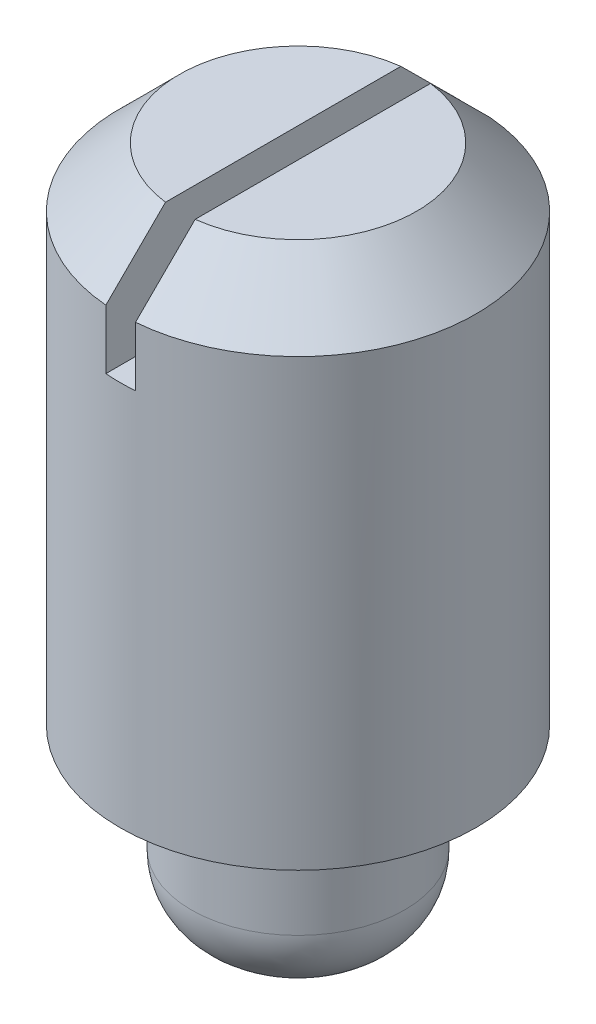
ISO-10303-21;
HEADER;
FILE_DESCRIPTION(('STEP AP214'),'2;1');
FILE_NAME('part.step','',(''),(''),'','','');
FILE_SCHEMA(('AUTOMOTIVE_DESIGN { 1 0 10303 214 1 1 1 1 }'));
ENDSEC;
DATA;
#1=APPLICATION_CONTEXT('core data for automotive mechanical design processes');
#2=APPLICATION_PROTOCOL_DEFINITION('international standard','automotive_design',2000,#1);
#3=PRODUCT_CONTEXT('',#1,'mechanical');
#4=PRODUCT('Part','Part','',(#3));
#5=PRODUCT_RELATED_PRODUCT_CATEGORY('part','',(#4));
#6=PRODUCT_DEFINITION_FORMATION('','',#4);
#7=PRODUCT_DEFINITION_CONTEXT('part definition',#1,'design');
#8=PRODUCT_DEFINITION('design','',#6,#7);
#9=PRODUCT_DEFINITION_SHAPE('','',#8);
#10=(LENGTH_UNIT() NAMED_UNIT(*) SI_UNIT(.MILLI.,.METRE.));
#11=(NAMED_UNIT(*) PLANE_ANGLE_UNIT() SI_UNIT($,.RADIAN.));
#12=(NAMED_UNIT(*) SI_UNIT($,.STERADIAN.) SOLID_ANGLE_UNIT());
#13=UNCERTAINTY_MEASURE_WITH_UNIT(LENGTH_MEASURE(1.E-05),#10,'distance_accuracy_value','');
#14=(GEOMETRIC_REPRESENTATION_CONTEXT(3) GLOBAL_UNCERTAINTY_ASSIGNED_CONTEXT((#13)) GLOBAL_UNIT_ASSIGNED_CONTEXT((#10,
#11,#12)) REPRESENTATION_CONTEXT('',''));
#15=CARTESIAN_POINT('',(0.,0.,0.));
#16=DIRECTION('',(0.,0.,1.));
#17=DIRECTION('',(1.,0.,0.));
#18=AXIS2_PLACEMENT_3D('',#15,#16,#17);
#19=CARTESIAN_POINT('',(0.,8.5,0.));
#20=DIRECTION('',(0.,1.,0.));
#21=DIRECTION('',(0.,0.,1.));
#22=AXIS2_PLACEMENT_3D('',#19,#20,#21);
#23=PLANE('',#22);
#24=DIRECTION('',(0.,0.,1.));
#25=VECTOR('',#24,1.);
#26=CARTESIAN_POINT('',(-0.25,8.5,-3.1191553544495));
#27=LINE('',#26,#25);
#28=CARTESIAN_POINT('',(-0.25,8.5,-1.98431348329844));
#29=VERTEX_POINT('',#28);
#30=CARTESIAN_POINT('',(-0.25,8.5,1.98431348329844));
#31=VERTEX_POINT('',#30);
#32=EDGE_CURVE('E88',#29,#31,#27,.T.);
#33=ORIENTED_EDGE('',*,*,#32,.F.);
#34=CARTESIAN_POINT('',(0.,8.5,0.));
#35=DIRECTION('',(0.,1.,0.));
#36=DIRECTION('',(0.,0.,1.));
#37=AXIS2_PLACEMENT_3D('',#34,#35,#36);
#38=CIRCLE('',#37,2.);
#39=EDGE_CURVE('E97',#29,#31,#38,.T.);
#40=ORIENTED_EDGE('',*,*,#39,.T.);
#41=EDGE_LOOP('',(#33,#40));
#42=FACE_BOUND('',#41,.T.);
#43=ADVANCED_FACE('F35',(#42),#23,.T.);
#44=CARTESIAN_POINT('',(0.,8.5,0.));
#45=DIRECTION('',(0.,-1.,0.));
#46=DIRECTION('',(0.,0.,-1.));
#47=AXIS2_PLACEMENT_3D('',#44,#45,#46);
#48=CONICAL_SURFACE('',#47,2.,0.785398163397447);
#49=CARTESIAN_POINT('',(-0.25,3.85014248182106,-6.64515650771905));
#50=CARTESIAN_POINT('',(-0.25,4.08043884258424,-6.41469591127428));
#51=CARTESIAN_POINT('',(-0.25,4.31072797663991,-6.18422809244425));
#52=CARTESIAN_POINT('',(-0.25,4.77128285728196,-5.72326810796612));
#53=CARTESIAN_POINT('',(-0.25,5.0015486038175,-5.49277594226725));
#54=CARTESIAN_POINT('',(-0.25,5.46205818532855,-5.03174693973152));
#55=CARTESIAN_POINT('',(-0.25,5.69230201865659,-4.80121010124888));
#56=CARTESIAN_POINT('',(-0.25,6.15273805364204,-4.34008582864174));
#57=CARTESIAN_POINT('',(-0.25,6.38293025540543,-4.10949839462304));
#58=CARTESIAN_POINT('',(-0.25,6.841542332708,-3.64993627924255));
#59=CARTESIAN_POINT('',(-0.25,7.069962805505,-3.42096219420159));
#60=CARTESIAN_POINT('',(-0.25,7.52665808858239,-2.96286612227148));
#61=CARTESIAN_POINT('',(-0.25,7.75493289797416,-2.73374413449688));
#62=CARTESIAN_POINT('',(-0.25,8.21119878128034,-2.27523083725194));
#63=CARTESIAN_POINT('',(-0.25,8.43918986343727,-2.04583953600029));
#64=CARTESIAN_POINT('',(-0.25,8.78060581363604,-1.70118943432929));
#65=CARTESIAN_POINT('',(-0.25,8.89431546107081,-1.58621277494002));
#66=CARTESIAN_POINT('',(-0.25,9.12137898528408,-1.35590884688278));
#67=CARTESIAN_POINT('',(-0.25,9.23473286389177,-1.24058158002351));
#68=CARTESIAN_POINT('',(-0.25,9.3787007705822,-1.09309500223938));
#69=CARTESIAN_POINT('',(-0.25,9.40968300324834,-1.06129546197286));
#70=CARTESIAN_POINT('',(-0.25,9.47156411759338,-0.99761535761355));
#71=CARTESIAN_POINT('',(-0.25,9.50246299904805,-0.965734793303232));
#72=CARTESIAN_POINT('',(-0.25,9.59506728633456,-0.869876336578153));
#73=CARTESIAN_POINT('',(-0.25,9.65661671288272,-0.805746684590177));
#74=CARTESIAN_POINT('',(-0.25,9.75868594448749,-0.698020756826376));
#75=CARTESIAN_POINT('',(-0.25,9.79943458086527,-0.654641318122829));
#76=CARTESIAN_POINT('',(-0.25,9.88021819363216,-0.567372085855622));
#77=CARTESIAN_POINT('',(-0.25,9.92025439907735,-0.523483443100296));
#78=CARTESIAN_POINT('',(-0.25,9.9860229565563,-0.44928573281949));
#79=CARTESIAN_POINT('',(-0.25,10.0121055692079,-0.41928765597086));
#80=CARTESIAN_POINT('',(-0.25,10.0634403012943,-0.358282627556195));
#81=CARTESIAN_POINT('',(-0.25,10.088686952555,-0.327270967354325));
#82=CARTESIAN_POINT('',(-0.25,10.1252181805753,-0.279403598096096));
#83=CARTESIAN_POINT('',(-0.25,10.13724277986,-0.263117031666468));
#84=CARTESIAN_POINT('',(-0.25,10.1605042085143,-0.229994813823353));
#85=CARTESIAN_POINT('',(-0.25,10.1717414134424,-0.213159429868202));
#86=CARTESIAN_POINT('',(-0.25,10.1929127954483,-0.178840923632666));
#87=CARTESIAN_POINT('',(-0.25,10.2028558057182,-0.161363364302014));
#88=CARTESIAN_POINT('',(-0.25,10.2207322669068,-0.125430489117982));
#89=CARTESIAN_POINT('',(-0.25,10.2286716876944,-0.10697828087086));
#90=CARTESIAN_POINT('',(-0.25,10.2407351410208,-0.0705946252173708));
#91=CARTESIAN_POINT('',(-0.25,10.2451332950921,-0.0527600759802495));
#92=CARTESIAN_POINT('',(-0.25,10.2500734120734,-0.0166397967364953));
#93=CARTESIAN_POINT('',(-0.25,10.2506413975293,0.00164203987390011));
#94=CARTESIAN_POINT('',(-0.25,10.2478040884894,0.0378157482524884));
#95=CARTESIAN_POINT('',(-0.25,10.2444092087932,0.0557085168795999));
#96=CARTESIAN_POINT('',(-0.25,10.2345851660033,0.0907392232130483));
#97=CARTESIAN_POINT('',(-0.25,10.2281306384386,0.107869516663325));
#98=CARTESIAN_POINT('',(-0.25,10.2144442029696,0.138562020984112));
#99=CARTESIAN_POINT('',(-0.25,10.2074993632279,0.152258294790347));
#100=CARTESIAN_POINT('',(-0.25,10.1926531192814,0.179128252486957));
#101=CARTESIAN_POINT('',(-0.25,10.1847509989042,0.192301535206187));
#102=CARTESIAN_POINT('',(-0.25,10.1600232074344,0.23128765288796));
#103=CARTESIAN_POINT('',(-0.25,10.1422227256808,0.256474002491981));
#104=CARTESIAN_POINT('',(-0.25,10.1051554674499,0.306055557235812));
#105=CARTESIAN_POINT('',(-0.25,10.0858771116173,0.33044179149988));
#106=CARTESIAN_POINT('',(-0.25,10.0465830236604,0.378519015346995));
#107=CARTESIAN_POINT('',(-0.25,10.0265690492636,0.402211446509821));
#108=CARTESIAN_POINT('',(-0.25,9.96670628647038,0.471649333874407));
#109=CARTESIAN_POINT('',(-0.25,9.92619261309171,0.516816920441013));
#110=CARTESIAN_POINT('',(-0.25,9.84433312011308,0.606395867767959));
#111=CARTESIAN_POINT('',(-0.25,9.80298714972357,0.650807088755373));
#112=CARTESIAN_POINT('',(-0.25,9.71977538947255,0.73923985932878));
#113=CARTESIAN_POINT('',(-0.25,9.67790903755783,0.783260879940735));
#114=CARTESIAN_POINT('',(-0.25,9.59389453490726,0.871025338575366));
#115=CARTESIAN_POINT('',(-0.25,9.55174640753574,0.914768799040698));
#116=CARTESIAN_POINT('',(-0.25,9.42569801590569,1.04504184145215));
#117=CARTESIAN_POINT('',(-0.25,9.3415297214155,1.13131190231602));
#118=CARTESIAN_POINT('',(-0.25,9.1728840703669,1.30346505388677));
#119=CARTESIAN_POINT('',(-0.25,9.08840688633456,1.38934831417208));
#120=CARTESIAN_POINT('',(-0.25,8.83446367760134,1.64692538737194));
#121=CARTESIAN_POINT('',(-0.25,8.6647008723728,1.81832652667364));
#122=CARTESIAN_POINT('',(-0.25,8.32486250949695,2.16081934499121));
#123=CARTESIAN_POINT('',(-0.25,8.15478695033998,2.33191102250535));
#124=CARTESIAN_POINT('',(-0.25,7.81443472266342,2.67395859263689));
#125=CARTESIAN_POINT('',(-0.25,7.64415802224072,2.84491445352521));
#126=CARTESIAN_POINT('',(-0.25,7.30350887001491,3.18673010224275));
#127=CARTESIAN_POINT('',(-0.25,7.1331364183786,3.35758989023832));
#128=CARTESIAN_POINT('',(-0.25,6.62108011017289,3.87093270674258));
#129=CARTESIAN_POINT('',(-0.25,6.27930673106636,4.21332643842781));
#130=CARTESIAN_POINT('',(-0.25,5.59566744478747,4.897990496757));
#131=CARTESIAN_POINT('',(-0.25,5.25380154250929,5.24026082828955));
#132=CARTESIAN_POINT('',(-0.25,4.73487095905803,5.75971138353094));
#133=CARTESIAN_POINT('',(-0.25,4.55782892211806,5.93691422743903));
#134=CARTESIAN_POINT('',(-0.25,4.20390695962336,6.29113175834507));
#135=CARTESIAN_POINT('',(-0.25,4.02702704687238,6.468146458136));
#136=CARTESIAN_POINT('',(-0.25,3.85014248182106,6.64515650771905));
#137=B_SPLINE_CURVE_WITH_KNOTS('',3,(#49,#50,#51,#52,#53,#54,#55,#56,#57,#58,#59,#60,#61,#62,
#63,#64,#65,#66,#67,#68,#69,#70,#71,#72,#73,#74,#75,#76,#77,#78,#79,#80,#81,#82,#83,#84,#85,#86,
#87,#88,#89,#90,#91,#92,#93,#94,#95,#96,#97,#98,#99,#100,#101,#102,#103,#104,#105,#106,#107,
#108,#109,#110,#111,#112,#113,#114,#115,#116,#117,#118,#119,#120,#121,#122,#123,#124,#125,#126,
#127,#128,#129,#130,#131,#132,#133,#134,#135,#136),.UNSPECIFIED.,.F.,.F.,(4,2,2,2,2,2,2,2,2,2,2,
2,2,2,2,2,2,2,2,2,2,2,2,2,2,2,2,2,2,2,2,2,2,2,2,2,2,2,2,2,2,2,2,4),(0.,0.977413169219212,
1.95482841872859,2.93229202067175,3.90975359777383,4.88003460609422,5.85032147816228,
6.82057947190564,7.30570370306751,7.79082543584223,7.924016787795,8.05720849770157,
8.32386479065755,8.50241290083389,8.6806152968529,8.79986327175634,8.91977897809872,
8.98049839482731,9.04118865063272,9.10144013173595,9.16150991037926,9.21629726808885,
9.2707120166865,9.32498407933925,9.37971414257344,9.42573656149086,9.4717936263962,
9.56421742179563,9.65745891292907,9.75049049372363,9.93248905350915,10.1145208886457,
10.2967702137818,10.4790046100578,10.8405837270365,11.2019848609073,11.9257096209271,
12.6494378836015,13.373302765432,14.0971663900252,15.5485045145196,16.9997768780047,
17.7512438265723,18.5019677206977),.UNSPECIFIED.);
#138=CARTESIAN_POINT('',(-0.25,7.49999999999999,-2.98956518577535));
#139=VERTEX_POINT('',#138);
#140=EDGE_CURVE('E85',#139,#29,#137,.T.);
#141=ORIENTED_EDGE('',*,*,#140,.F.);
#142=CARTESIAN_POINT('',(0.,7.49999999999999,0.));
#143=DIRECTION('',(0.,1.,0.));
#144=DIRECTION('',(0.,0.,1.));
#145=AXIS2_PLACEMENT_3D('',#142,#143,#144);
#146=CIRCLE('',#145,3.);
#147=CARTESIAN_POINT('',(-0.25,7.49999999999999,2.98956518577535));
#148=VERTEX_POINT('',#147);
#149=EDGE_CURVE('E109',#148,#139,#146,.F.);
#150=ORIENTED_EDGE('',*,*,#149,.F.);
#151=EDGE_CURVE('E94',#31,#148,#137,.T.);
#152=ORIENTED_EDGE('',*,*,#151,.F.);
#153=ORIENTED_EDGE('',*,*,#39,.F.);
#154=EDGE_LOOP('',(#141,#150,#152,#153));
#155=FACE_BOUND('',#154,.T.);
#156=ADVANCED_FACE('F99',(#155),#48,.T.);
#157=CARTESIAN_POINT('',(0.,0.,0.));
#158=DIRECTION('',(0.,1.,0.));
#159=DIRECTION('',(0.,0.,1.));
#160=AXIS2_PLACEMENT_3D('',#157,#158,#159);
#161=PLANE('',#160);
#162=CARTESIAN_POINT('',(0.,0.,0.));
#163=DIRECTION('',(0.,1.,0.));
#164=DIRECTION('',(0.,0.,1.));
#165=AXIS2_PLACEMENT_3D('',#162,#163,#164);
#166=CIRCLE('',#165,2.3);
#167=CARTESIAN_POINT('',(0.,0.,2.3));
#168=VERTEX_POINT('',#167);
#169=EDGE_CURVE('E114',#168,#168,#166,.T.);
#170=ORIENTED_EDGE('',*,*,#169,.T.);
#171=EDGE_LOOP('',(#170));
#172=FACE_BOUND('',#171,.T.);
#173=CARTESIAN_POINT('',(0.,0.,0.));
#174=DIRECTION('',(0.,1.,0.));
#175=DIRECTION('',(0.,0.,1.));
#176=AXIS2_PLACEMENT_3D('',#173,#174,#175);
#177=CIRCLE('',#176,3.);
#178=CARTESIAN_POINT('',(0.,0.,3.));
#179=VERTEX_POINT('',#178);
#180=EDGE_CURVE('E101',#179,#179,#177,.T.);
#181=ORIENTED_EDGE('',*,*,#180,.F.);
#182=EDGE_LOOP('',(#181));
#183=FACE_BOUND('',#182,.T.);
#184=ADVANCED_FACE('F166',(#172,#183),#161,.F.);
#185=CARTESIAN_POINT('',(0.,8.5,0.));
#186=DIRECTION('',(0.,-1.,0.));
#187=DIRECTION('',(0.,0.,-1.));
#188=AXIS2_PLACEMENT_3D('',#185,#186,#187);
#189=CYLINDRICAL_SURFACE('',#188,3.);
#190=ORIENTED_EDGE('',*,*,#149,.T.);
#191=DIRECTION('',(0.,-1.,0.));
#192=VECTOR('',#191,1.);
#193=CARTESIAN_POINT('',(-0.25,8.5,-2.98956518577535));
#194=LINE('',#193,#192);
#195=CARTESIAN_POINT('',(-0.25,6.5,-2.98956518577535));
#196=VERTEX_POINT('',#195);
#197=EDGE_CURVE('E58',#139,#196,#194,.T.);
#198=ORIENTED_EDGE('',*,*,#197,.T.);
#199=CARTESIAN_POINT('',(0.,6.5,0.));
#200=DIRECTION('',(0.,1.,0.));
#201=DIRECTION('',(0.,0.,1.));
#202=AXIS2_PLACEMENT_3D('',#199,#200,#201);
#203=CIRCLE('',#202,3.);
#204=CARTESIAN_POINT('',(0.249999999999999,6.5,-2.98956518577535));
#205=VERTEX_POINT('',#204);
#206=EDGE_CURVE('E11',#205,#196,#203,.T.);
#207=ORIENTED_EDGE('',*,*,#206,.F.);
#208=DIRECTION('',(0.,-1.,0.));
#209=VECTOR('',#208,1.);
#210=CARTESIAN_POINT('',(0.25,8.5,-2.98956518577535));
#211=LINE('',#210,#209);
#212=CARTESIAN_POINT('',(0.25,7.49999999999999,-2.98956518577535));
#213=VERTEX_POINT('',#212);
#214=EDGE_CURVE('E186',#205,#213,#211,.F.);
#215=ORIENTED_EDGE('',*,*,#214,.T.);
#216=CARTESIAN_POINT('',(0.25,7.49999999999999,2.98956518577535));
#217=VERTEX_POINT('',#216);
#218=EDGE_CURVE('E104',#213,#217,#146,.F.);
#219=ORIENTED_EDGE('',*,*,#218,.T.);
#220=DIRECTION('',(0.,-1.,0.));
#221=VECTOR('',#220,1.);
#222=CARTESIAN_POINT('',(0.25,8.5,2.98956518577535));
#223=LINE('',#222,#221);
#224=CARTESIAN_POINT('',(0.249999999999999,6.5,2.98956518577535));
#225=VERTEX_POINT('',#224);
#226=EDGE_CURVE('E191',#217,#225,#223,.T.);
#227=ORIENTED_EDGE('',*,*,#226,.T.);
#228=CARTESIAN_POINT('',(-0.25,6.5,2.98956518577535));
#229=VERTEX_POINT('',#228);
#230=EDGE_CURVE('E39',#229,#225,#203,.T.);
#231=ORIENTED_EDGE('',*,*,#230,.F.);
#232=DIRECTION('',(0.,-1.,0.));
#233=VECTOR('',#232,1.);
#234=CARTESIAN_POINT('',(-0.25,8.5,2.98956518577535));
#235=LINE('',#234,#233);
#236=EDGE_CURVE('E194',#229,#148,#235,.F.);
#237=ORIENTED_EDGE('',*,*,#236,.T.);
#238=EDGE_LOOP('',(#190,#198,#207,#215,#219,#227,#231,#237));
#239=FACE_BOUND('',#238,.T.);
#240=ORIENTED_EDGE('',*,*,#180,.T.);
#241=EDGE_LOOP('',(#240));
#242=FACE_BOUND('',#241,.T.);
#243=ADVANCED_FACE('F37',(#239,#242),#189,.T.);
#244=DIRECTION('',(0.,0.,-1.));
#245=VECTOR('',#244,1.);
#246=CARTESIAN_POINT('',(0.25,8.5,-3.1191553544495));
#247=LINE('',#246,#245);
#248=CARTESIAN_POINT('',(0.249999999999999,8.5,1.98431348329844));
#249=VERTEX_POINT('',#248);
#250=CARTESIAN_POINT('',(0.25,8.5,-1.98431348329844));
#251=VERTEX_POINT('',#250);
#252=EDGE_CURVE('E50',#249,#251,#247,.T.);
#253=ORIENTED_EDGE('',*,*,#252,.F.);
#254=EDGE_CURVE('E100',#249,#251,#38,.T.);
#255=ORIENTED_EDGE('',*,*,#254,.T.);
#256=EDGE_LOOP('',(#253,#255));
#257=FACE_BOUND('',#256,.T.);
#258=ADVANCED_FACE('F162',(#257),#23,.T.);
#259=CARTESIAN_POINT('',(0.,3.,0.));
#260=DIRECTION('',(0.,-1.,0.));
#261=DIRECTION('',(0.,0.,-1.));
#262=AXIS2_PLACEMENT_3D('',#259,#260,#261);
#263=CYLINDRICAL_SURFACE('',#262,1.8);
#264=CARTESIAN_POINT('',(0.,-1.8,0.));
#265=DIRECTION('',(0.,1.,0.));
#266=DIRECTION('',(0.,0.,1.));
#267=AXIS2_PLACEMENT_3D('',#264,#265,#266);
#268=CIRCLE('',#267,1.8);
#269=CARTESIAN_POINT('',(0.,-1.8,1.8));
#270=VERTEX_POINT('',#269);
#271=EDGE_CURVE('E117',#270,#270,#268,.T.);
#272=ORIENTED_EDGE('',*,*,#271,.T.);
#273=EDGE_LOOP('',(#272));
#274=FACE_BOUND('',#273,.T.);
#275=CARTESIAN_POINT('',(0.,-0.5,0.));
#276=DIRECTION('',(0.,1.,0.));
#277=DIRECTION('',(0.,0.,1.));
#278=AXIS2_PLACEMENT_3D('',#275,#276,#277);
#279=CIRCLE('',#278,1.8);
#280=CARTESIAN_POINT('',(0.,-0.5,1.8));
#281=VERTEX_POINT('',#280);
#282=EDGE_CURVE('E111',#281,#281,#279,.F.);
#283=ORIENTED_EDGE('',*,*,#282,.T.);
#284=EDGE_LOOP('',(#283));
#285=FACE_BOUND('',#284,.T.);
#286=ADVANCED_FACE('F169',(#274,#285),#263,.T.);
#287=CARTESIAN_POINT('',(0.,-3.,0.));
#288=DIRECTION('',(0.,1.,0.));
#289=DIRECTION('',(0.,0.,1.));
#290=AXIS2_PLACEMENT_3D('',#287,#288,#289);
#291=PLANE('',#290);
#292=CARTESIAN_POINT('',(0.,-3.,0.));
#293=DIRECTION('',(0.,1.,0.));
#294=DIRECTION('',(0.,0.,1.));
#295=AXIS2_PLACEMENT_3D('',#292,#293,#294);
#296=CIRCLE('',#295,0.6);
#297=CARTESIAN_POINT('',(0.,-3.,0.6));
#298=VERTEX_POINT('',#297);
#299=EDGE_CURVE('E120',#298,#298,#296,.F.);
#300=ORIENTED_EDGE('',*,*,#299,.T.);
#301=EDGE_LOOP('',(#300));
#302=FACE_BOUND('',#301,.T.);
#303=ADVANCED_FACE('F157',(#302),#291,.F.);
#304=CARTESIAN_POINT('',(0.25,3.85014248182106,6.64515650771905));
#305=CARTESIAN_POINT('',(0.25,4.08043884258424,6.41469591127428));
#306=CARTESIAN_POINT('',(0.25,4.31072797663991,6.18422809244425));
#307=CARTESIAN_POINT('',(0.25,4.77128285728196,5.72326810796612));
#308=CARTESIAN_POINT('',(0.25,5.0015486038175,5.49277594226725));
#309=CARTESIAN_POINT('',(0.25,5.46205818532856,5.03174693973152));
#310=CARTESIAN_POINT('',(0.25,5.69230201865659,4.80121010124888));
#311=CARTESIAN_POINT('',(0.25,6.15273805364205,4.34008582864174));
#312=CARTESIAN_POINT('',(0.25,6.38293025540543,4.10949839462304));
#313=CARTESIAN_POINT('',(0.25,6.841542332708,3.64993627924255));
#314=CARTESIAN_POINT('',(0.25,7.069962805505,3.42096219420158));
#315=CARTESIAN_POINT('',(0.25,7.5266580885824,2.96286612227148));
#316=CARTESIAN_POINT('',(0.25,7.75493289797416,2.73374413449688));
#317=CARTESIAN_POINT('',(0.25,8.21119878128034,2.27523083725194));
#318=CARTESIAN_POINT('',(0.25,8.43918986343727,2.04583953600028));
#319=CARTESIAN_POINT('',(0.25,8.78060581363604,1.70118943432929));
#320=CARTESIAN_POINT('',(0.25,8.89431546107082,1.58621277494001));
#321=CARTESIAN_POINT('',(0.25,9.12137898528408,1.35590884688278));
#322=CARTESIAN_POINT('',(0.25,9.23473286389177,1.24058158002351));
#323=CARTESIAN_POINT('',(0.25,9.3787007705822,1.09309500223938));
#324=CARTESIAN_POINT('',(0.25,9.40968300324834,1.06129546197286));
#325=CARTESIAN_POINT('',(0.25,9.47156411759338,0.997615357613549));
#326=CARTESIAN_POINT('',(0.25,9.50246299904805,0.96573479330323));
#327=CARTESIAN_POINT('',(0.25,9.59506728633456,0.869876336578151));
#328=CARTESIAN_POINT('',(0.25,9.65661671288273,0.805746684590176));
#329=CARTESIAN_POINT('',(0.25,9.75868594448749,0.698020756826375));
#330=CARTESIAN_POINT('',(0.25,9.79943458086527,0.654641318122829));
#331=CARTESIAN_POINT('',(0.25,9.88021819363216,0.567372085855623));
#332=CARTESIAN_POINT('',(0.25,9.92025439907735,0.523483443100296));
#333=CARTESIAN_POINT('',(0.25,9.9860229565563,0.44928573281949));
#334=CARTESIAN_POINT('',(0.25,10.0121055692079,0.41928765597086));
#335=CARTESIAN_POINT('',(0.25,10.0634403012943,0.358282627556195));
#336=CARTESIAN_POINT('',(0.25,10.088686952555,0.327270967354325));
#337=CARTESIAN_POINT('',(0.25,10.1252181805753,0.279403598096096));
#338=CARTESIAN_POINT('',(0.25,10.13724277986,0.263117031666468));
#339=CARTESIAN_POINT('',(0.25,10.1605042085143,0.229994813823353));
#340=CARTESIAN_POINT('',(0.25,10.1717414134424,0.213159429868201));
#341=CARTESIAN_POINT('',(0.25,10.1929127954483,0.178840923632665));
#342=CARTESIAN_POINT('',(0.25,10.2028558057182,0.161363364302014));
#343=CARTESIAN_POINT('',(0.25,10.2207322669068,0.125430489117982));
#344=CARTESIAN_POINT('',(0.25,10.2286716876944,0.106978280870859));
#345=CARTESIAN_POINT('',(0.25,10.2407351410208,0.0705946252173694));
#346=CARTESIAN_POINT('',(0.25,10.2451332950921,0.0527600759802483));
#347=CARTESIAN_POINT('',(0.25,10.2500734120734,0.0166397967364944));
#348=CARTESIAN_POINT('',(0.25,10.2506413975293,-0.00164203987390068));
#349=CARTESIAN_POINT('',(0.25,10.2478040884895,-0.0378157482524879));
#350=CARTESIAN_POINT('',(0.25,10.2444092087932,-0.0557085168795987));
#351=CARTESIAN_POINT('',(0.25,10.2345851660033,-0.0907392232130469));
#352=CARTESIAN_POINT('',(0.25,10.2281306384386,-0.107869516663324));
#353=CARTESIAN_POINT('',(0.25,10.2144442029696,-0.138562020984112));
#354=CARTESIAN_POINT('',(0.25,10.2074993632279,-0.152258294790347));
#355=CARTESIAN_POINT('',(0.25,10.1926531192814,-0.179128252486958));
#356=CARTESIAN_POINT('',(0.25,10.1847509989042,-0.192301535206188));
#357=CARTESIAN_POINT('',(0.25,10.1600232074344,-0.23128765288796));
#358=CARTESIAN_POINT('',(0.25,10.1422227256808,-0.256474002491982));
#359=CARTESIAN_POINT('',(0.25,10.1051554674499,-0.306055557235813));
#360=CARTESIAN_POINT('',(0.25,10.0858771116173,-0.33044179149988));
#361=CARTESIAN_POINT('',(0.25,10.0465830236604,-0.378519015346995));
#362=CARTESIAN_POINT('',(0.25,10.0265690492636,-0.40221144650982));
#363=CARTESIAN_POINT('',(0.25,9.96670628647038,-0.471649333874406));
#364=CARTESIAN_POINT('',(0.25,9.92619261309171,-0.516816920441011));
#365=CARTESIAN_POINT('',(0.25,9.84433312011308,-0.606395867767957));
#366=CARTESIAN_POINT('',(0.25,9.80298714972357,-0.650807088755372));
#367=CARTESIAN_POINT('',(0.25,9.71977538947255,-0.739239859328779));
#368=CARTESIAN_POINT('',(0.25,9.67790903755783,-0.783260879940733));
#369=CARTESIAN_POINT('',(0.25,9.59389453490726,-0.871025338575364));
#370=CARTESIAN_POINT('',(0.25,9.55174640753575,-0.914768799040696));
#371=CARTESIAN_POINT('',(0.25,9.42569801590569,-1.04504184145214));
#372=CARTESIAN_POINT('',(0.25,9.3415297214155,-1.13131190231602));
#373=CARTESIAN_POINT('',(0.25,9.1728840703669,-1.30346505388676));
#374=CARTESIAN_POINT('',(0.25,9.08840688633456,-1.38934831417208));
#375=CARTESIAN_POINT('',(0.25,8.83446367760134,-1.64692538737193));
#376=CARTESIAN_POINT('',(0.25,8.6647008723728,-1.81832652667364));
#377=CARTESIAN_POINT('',(0.25,8.32486250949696,-2.16081934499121));
#378=CARTESIAN_POINT('',(0.25,8.15478695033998,-2.33191102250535));
#379=CARTESIAN_POINT('',(0.25,7.81443472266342,-2.67395859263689));
#380=CARTESIAN_POINT('',(0.25,7.64415802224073,-2.8449144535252));
#381=CARTESIAN_POINT('',(0.25,7.30350887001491,-3.18673010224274));
#382=CARTESIAN_POINT('',(0.25,7.13313641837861,-3.35758989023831));
#383=CARTESIAN_POINT('',(0.25,6.6210801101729,-3.87093270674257));
#384=CARTESIAN_POINT('',(0.25,6.27930673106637,-4.2133264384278));
#385=CARTESIAN_POINT('',(0.25,5.59566744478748,-4.89799049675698));
#386=CARTESIAN_POINT('',(0.25,5.25380154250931,-5.24026082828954));
#387=CARTESIAN_POINT('',(0.25,4.73487095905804,-5.75971138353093));
#388=CARTESIAN_POINT('',(0.25,4.55782892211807,-5.93691422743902));
#389=CARTESIAN_POINT('',(0.25,4.20390695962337,-6.29113175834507));
#390=CARTESIAN_POINT('',(0.25,4.02702704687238,-6.46814645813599));
#391=CARTESIAN_POINT('',(0.25,3.85014248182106,-6.64515650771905));
#392=B_SPLINE_CURVE_WITH_KNOTS('',3,(#304,#305,#306,#307,#308,#309,#310,#311,#312,#313,#314,
#315,#316,#317,#318,#319,#320,#321,#322,#323,#324,#325,#326,#327,#328,#329,#330,#331,#332,#333,
#334,#335,#336,#337,#338,#339,#340,#341,#342,#343,#344,#345,#346,#347,#348,#349,#350,#351,#352,
#353,#354,#355,#356,#357,#358,#359,#360,#361,#362,#363,#364,#365,#366,#367,#368,#369,#370,#371,
#372,#373,#374,#375,#376,#377,#378,#379,#380,#381,#382,#383,#384,#385,#386,#387,#388,#389,#390,
#391),.UNSPECIFIED.,.F.,.F.,(4,2,2,2,2,2,2,2,2,2,2,2,2,2,2,2,2,2,2,2,2,2,2,2,2,2,2,2,2,2,2,2,2,
2,2,2,2,2,2,2,2,2,2,4),(0.,0.977413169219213,1.95482841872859,2.93229202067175,3.90975359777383,
4.88003460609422,5.85032147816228,6.82057947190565,7.30570370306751,7.79082543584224,
7.92401678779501,8.05720849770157,8.32386479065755,8.50241290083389,8.6806152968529,
8.79986327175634,8.91977897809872,8.98049839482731,9.04118865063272,9.10144013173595,
9.16150991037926,9.21629726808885,9.2707120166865,9.32498407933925,9.37971414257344,
9.42573656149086,9.4717936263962,9.56421742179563,9.65745891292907,9.75049049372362,
9.93248905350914,10.1145208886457,10.2967702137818,10.4790046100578,10.8405837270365,
11.2019848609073,11.9257096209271,12.6494378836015,13.373302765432,14.0971663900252,
15.5485045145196,16.9997768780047,17.7512438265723,18.5019677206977),.UNSPECIFIED.);
#393=EDGE_CURVE('E130',#217,#249,#392,.T.);
#394=ORIENTED_EDGE('',*,*,#393,.F.);
#395=ORIENTED_EDGE('',*,*,#218,.F.);
#396=EDGE_CURVE('E123',#251,#213,#392,.T.);
#397=ORIENTED_EDGE('',*,*,#396,.F.);
#398=ORIENTED_EDGE('',*,*,#254,.F.);
#399=EDGE_LOOP('',(#394,#395,#397,#398));
#400=FACE_BOUND('',#399,.T.);
#401=ADVANCED_FACE('F136',(#400),#48,.T.);
#402=CARTESIAN_POINT('',(0.,-0.5,0.));
#403=DIRECTION('',(0.,1.,0.));
#404=DIRECTION('',(0.,0.,1.));
#405=AXIS2_PLACEMENT_3D('',#402,#403,#404);
#406=TOROIDAL_SURFACE('',#405,2.3,0.5);
#407=ORIENTED_EDGE('',*,*,#169,.F.);
#408=EDGE_LOOP('',(#407));
#409=FACE_BOUND('',#408,.T.);
#410=ORIENTED_EDGE('',*,*,#282,.F.);
#411=EDGE_LOOP('',(#410));
#412=FACE_BOUND('',#411,.T.);
#413=ADVANCED_FACE('F150',(#409,#412),#406,.F.);
#414=CARTESIAN_POINT('',(0.,-1.8,0.));
#415=DIRECTION('',(0.,1.,0.));
#416=DIRECTION('',(0.,0.,1.));
#417=AXIS2_PLACEMENT_3D('',#414,#415,#416);
#418=DEGENERATE_TOROIDAL_SURFACE('',#417,0.6,1.2,.T.);
#419=ORIENTED_EDGE('',*,*,#299,.F.);
#420=EDGE_LOOP('',(#419));
#421=FACE_BOUND('',#420,.T.);
#422=ORIENTED_EDGE('',*,*,#271,.F.);
#423=EDGE_LOOP('',(#422));
#424=FACE_BOUND('',#423,.T.);
#425=ADVANCED_FACE('F148',(#421,#424),#418,.T.);
#426=CARTESIAN_POINT('',(-0.25,6.5,3.14127702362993));
#427=DIRECTION('',(0.,1.,0.));
#428=DIRECTION('',(0.,0.,1.));
#429=AXIS2_PLACEMENT_3D('',#426,#427,#428);
#430=PLANE('',#429);
#431=ORIENTED_EDGE('',*,*,#206,.T.);
#432=DIRECTION('',(0.,0.,1.));
#433=VECTOR('',#432,1.);
#434=CARTESIAN_POINT('',(-0.25,6.5,-3.1191553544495));
#435=LINE('',#434,#433);
#436=EDGE_CURVE('E179',#196,#229,#435,.T.);
#437=ORIENTED_EDGE('',*,*,#436,.T.);
#438=ORIENTED_EDGE('',*,*,#230,.T.);
#439=DIRECTION('',(0.,0.,-1.));
#440=VECTOR('',#439,1.);
#441=CARTESIAN_POINT('',(0.25,6.5,-3.1191553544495));
#442=LINE('',#441,#440);
#443=EDGE_CURVE('E192',#225,#205,#442,.T.);
#444=ORIENTED_EDGE('',*,*,#443,.T.);
#445=EDGE_LOOP('',(#431,#437,#438,#444));
#446=FACE_BOUND('',#445,.T.);
#447=ADVANCED_FACE('F144',(#446),#430,.T.);
#448=CARTESIAN_POINT('',(-0.25,6.5,-3.1191553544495));
#449=DIRECTION('',(-1.,0.,0.));
#450=DIRECTION('',(0.,0.,1.));
#451=AXIS2_PLACEMENT_3D('',#448,#449,#450);
#452=PLANE('',#451);
#453=ORIENTED_EDGE('',*,*,#140,.T.);
#454=ORIENTED_EDGE('',*,*,#32,.T.);
#455=ORIENTED_EDGE('',*,*,#151,.T.);
#456=ORIENTED_EDGE('',*,*,#236,.F.);
#457=ORIENTED_EDGE('',*,*,#436,.F.);
#458=ORIENTED_EDGE('',*,*,#197,.F.);
#459=EDGE_LOOP('',(#453,#454,#455,#456,#457,#458));
#460=FACE_BOUND('',#459,.T.);
#461=ADVANCED_FACE('F87',(#460),#452,.F.);
#462=CARTESIAN_POINT('',(0.25,6.5,-3.1191553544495));
#463=DIRECTION('',(1.,0.,0.));
#464=DIRECTION('',(0.,0.,-1.));
#465=AXIS2_PLACEMENT_3D('',#462,#463,#464);
#466=PLANE('',#465);
#467=ORIENTED_EDGE('',*,*,#393,.T.);
#468=ORIENTED_EDGE('',*,*,#252,.T.);
#469=ORIENTED_EDGE('',*,*,#396,.T.);
#470=ORIENTED_EDGE('',*,*,#214,.F.);
#471=ORIENTED_EDGE('',*,*,#443,.F.);
#472=ORIENTED_EDGE('',*,*,#226,.F.);
#473=EDGE_LOOP('',(#467,#468,#469,#470,#471,#472));
#474=FACE_BOUND('',#473,.T.);
#475=ADVANCED_FACE('F140',(#474),#466,.F.);
#476=CLOSED_SHELL('',(#43,#156,#184,#243,#258,#286,#303,#401,#413,#425,#447,#461,#475));
#477=MANIFOLD_SOLID_BREP('B2',#476);
#478=ADVANCED_BREP_SHAPE_REPRESENTATION('',(#18,#477),#14);
#479=SHAPE_DEFINITION_REPRESENTATION(#9,#478);
ENDSEC;
END-ISO-10303-21;
